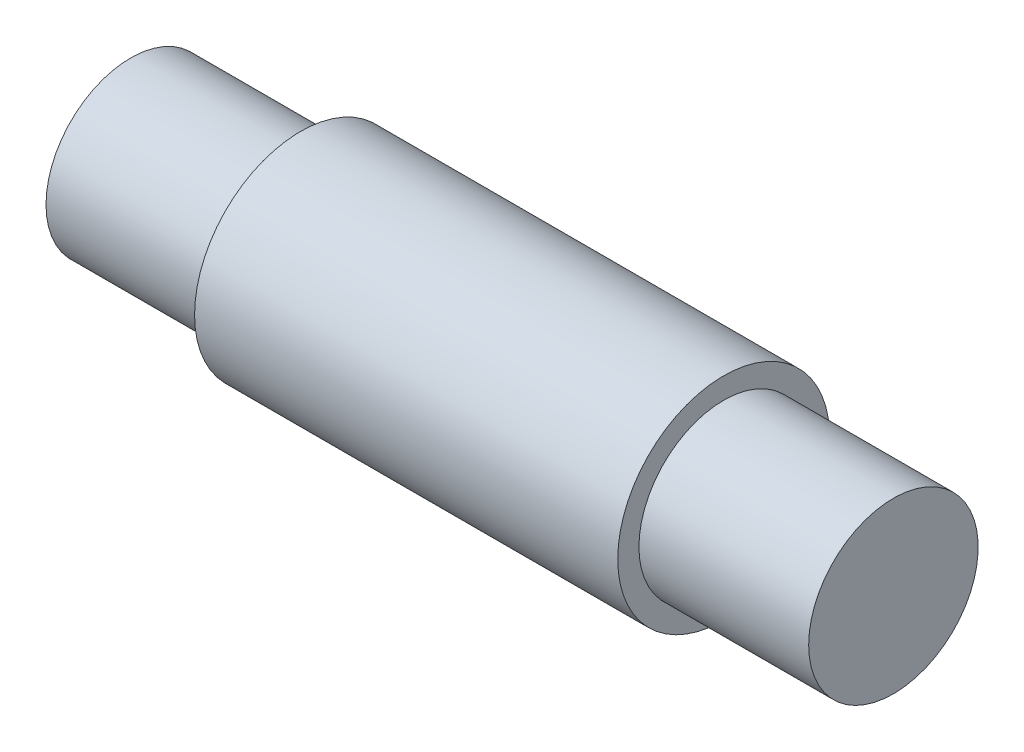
from build123d import *


with BuildPart() as part:
    # Sketch1 → Revolve1 (revolve)
    with BuildSketch(Plane.XY, mode=Mode.PRIVATE) as revolve1_sk:
        Polygon((-14.2875, 0), (-14.2875, 3.175), (-7.9275, 3.175), (-7.9275, 3.96875), (7.9275, 3.96875), (7.9275, 3.175), (14.2875, 3.175), (14.2875, 0), align=None)
    revolve(revolve1_sk.sketch.rotate(Axis((-76.456488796, 0, 0), (1, 0, 0)), 90), axis=Axis((-76.456488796, 0, 0), (1, 0, 0)))


solid = part.part
